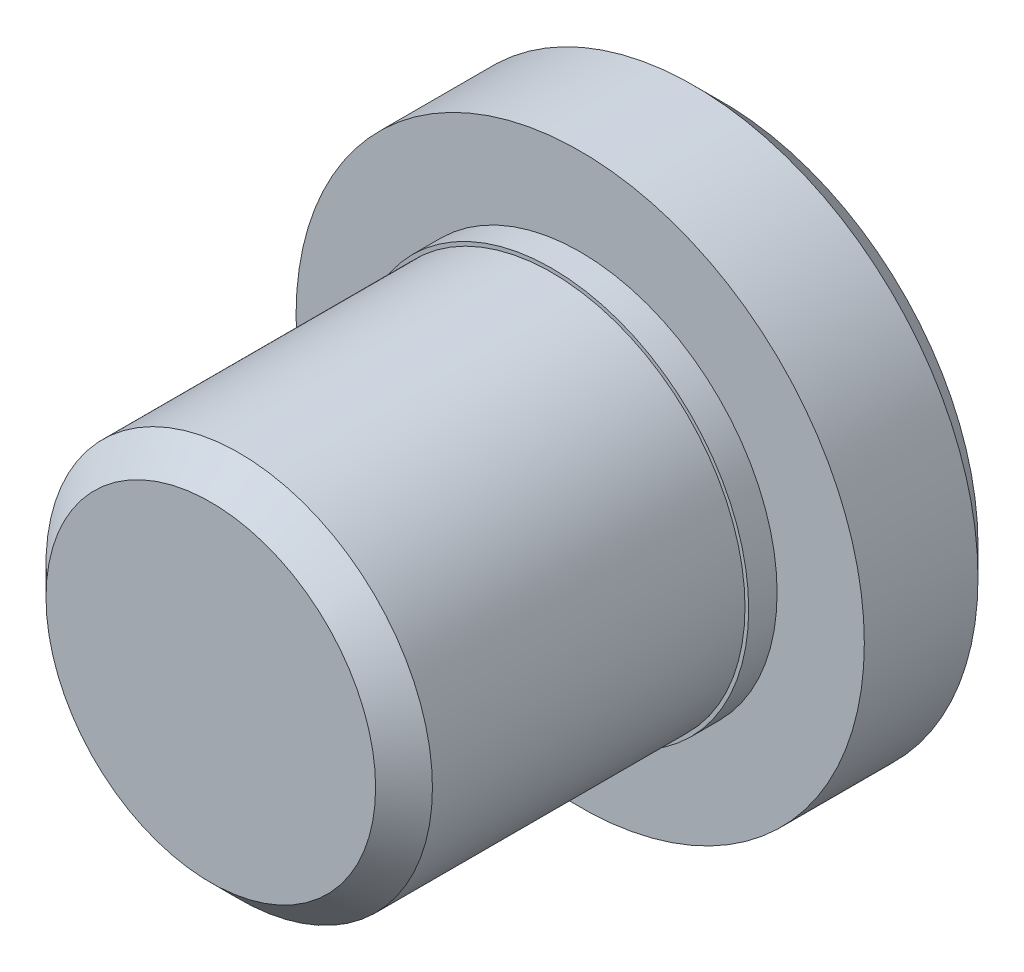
ISO-10303-21;
HEADER;
FILE_DESCRIPTION(('STEP AP214'),'2;1');
FILE_NAME('part.step','',(''),(''),'','','');
FILE_SCHEMA(('AUTOMOTIVE_DESIGN { 1 0 10303 214 1 1 1 1 }'));
ENDSEC;
DATA;
#1=APPLICATION_CONTEXT('core data for automotive mechanical design processes');
#2=APPLICATION_PROTOCOL_DEFINITION('international standard','automotive_design',2000,#1);
#3=PRODUCT_CONTEXT('',#1,'mechanical');
#4=PRODUCT('Part','Part','',(#3));
#5=PRODUCT_RELATED_PRODUCT_CATEGORY('part','',(#4));
#6=PRODUCT_DEFINITION_FORMATION('','',#4);
#7=PRODUCT_DEFINITION_CONTEXT('part definition',#1,'design');
#8=PRODUCT_DEFINITION('design','',#6,#7);
#9=PRODUCT_DEFINITION_SHAPE('','',#8);
#10=(LENGTH_UNIT() NAMED_UNIT(*) SI_UNIT(.MILLI.,.METRE.));
#11=(NAMED_UNIT(*) PLANE_ANGLE_UNIT() SI_UNIT($,.RADIAN.));
#12=(NAMED_UNIT(*) SI_UNIT($,.STERADIAN.) SOLID_ANGLE_UNIT());
#13=UNCERTAINTY_MEASURE_WITH_UNIT(LENGTH_MEASURE(1.E-05),#10,'distance_accuracy_value','');
#14=(GEOMETRIC_REPRESENTATION_CONTEXT(3) GLOBAL_UNCERTAINTY_ASSIGNED_CONTEXT((#13)) GLOBAL_UNIT_ASSIGNED_CONTEXT((#10,
#11,#12)) REPRESENTATION_CONTEXT('',''));
#15=CARTESIAN_POINT('',(0.,0.,0.));
#16=DIRECTION('',(0.,0.,1.));
#17=DIRECTION('',(1.,0.,0.));
#18=AXIS2_PLACEMENT_3D('',#15,#16,#17);
#19=CARTESIAN_POINT('',(0.,0.,0.));
#20=DIRECTION('',(0.,0.,1.));
#21=DIRECTION('',(1.,0.,0.));
#22=AXIS2_PLACEMENT_3D('',#19,#20,#21);
#23=CYLINDRICAL_SURFACE('',#22,1.621);
#24=CARTESIAN_POINT('',(0.,0.,6.99999999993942));
#25=DIRECTION('',(0.,0.,1.));
#26=DIRECTION('',(1.,0.,0.));
#27=AXIS2_PLACEMENT_3D('',#24,#25,#26);
#28=CIRCLE('',#27,1.621);
#29=CARTESIAN_POINT('',(1.621,0.,6.99999999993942));
#30=VERTEX_POINT('',#29);
#31=EDGE_CURVE('E11',#30,#30,#28,.T.);
#32=ORIENTED_EDGE('',*,*,#31,.T.);
#33=EDGE_LOOP('',(#32));
#34=FACE_BOUND('',#33,.T.);
#35=CARTESIAN_POINT('',(0.,0.,0.378999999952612));
#36=DIRECTION('',(0.,0.,1.));
#37=DIRECTION('',(1.,0.,0.));
#38=AXIS2_PLACEMENT_3D('',#35,#36,#37);
#39=CIRCLE('',#38,1.621);
#40=CARTESIAN_POINT('',(1.621,0.,0.378999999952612));
#41=VERTEX_POINT('',#40);
#42=EDGE_CURVE('E55',#41,#41,#39,.T.);
#43=ORIENTED_EDGE('',*,*,#42,.F.);
#44=EDGE_LOOP('',(#43));
#45=FACE_BOUND('',#44,.T.);
#46=ADVANCED_FACE('F36',(#34,#45),#23,.F.);
#47=CARTESIAN_POINT('',(0.,0.,6.99999999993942));
#48=DIRECTION('',(0.,0.,-1.));
#49=DIRECTION('',(-1.,0.,0.));
#50=AXIS2_PLACEMENT_3D('',#47,#48,#49);
#51=CONICAL_SURFACE('',#50,1.621,1.04719755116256);
#52=CARTESIAN_POINT('',(-6.37112433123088E-11,0.,7.93588478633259));
#53=VERTEX_POINT('',#52);
#54=VERTEX_LOOP('',#53);
#55=FACE_BOUND('',#54,.T.);
#56=ORIENTED_EDGE('',*,*,#31,.F.);
#57=EDGE_LOOP('',(#56));
#58=FACE_BOUND('',#57,.T.);
#59=ADVANCED_FACE('F45',(#55,#58),#51,.F.);
#60=CARTESIAN_POINT('',(-6.37112433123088E-11,0.,8.9999999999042));
#61=DIRECTION('',(0.,0.,1.));
#62=DIRECTION('',(1.,0.,0.));
#63=AXIS2_PLACEMENT_3D('',#60,#61,#62);
#64=PLANE('',#63);
#65=CARTESIAN_POINT('',(0.,0.,8.9999999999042));
#66=DIRECTION('',(0.,0.,1.));
#67=DIRECTION('',(1.,0.,0.));
#68=AXIS2_PLACEMENT_3D('',#65,#66,#67);
#69=CIRCLE('',#68,2.90000000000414);
#70=CARTESIAN_POINT('',(2.90000000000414,0.,8.9999999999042));
#71=VERTEX_POINT('',#70);
#72=EDGE_CURVE('E42',#71,#71,#69,.T.);
#73=ORIENTED_EDGE('',*,*,#72,.T.);
#74=EDGE_LOOP('',(#73));
#75=FACE_BOUND('',#74,.T.);
#76=ADVANCED_FACE('F48',(#75),#64,.T.);
#77=CARTESIAN_POINT('',(0.,0.,8.9999999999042));
#78=DIRECTION('',(0.,0.,-1.));
#79=DIRECTION('',(-1.,0.,0.));
#80=AXIS2_PLACEMENT_3D('',#77,#78,#79);
#81=CONICAL_SURFACE('',#80,2.90000000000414,0.785398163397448);
#82=CARTESIAN_POINT('',(0.,0.,8.49999999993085));
#83=DIRECTION('',(0.,0.,1.));
#84=DIRECTION('',(1.,0.,0.));
#85=AXIS2_PLACEMENT_3D('',#82,#83,#84);
#86=CIRCLE('',#85,3.39999999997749);
#87=CARTESIAN_POINT('',(3.39999999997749,0.,8.49999999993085));
#88=VERTEX_POINT('',#87);
#89=EDGE_CURVE('E80',#88,#88,#86,.T.);
#90=ORIENTED_EDGE('',*,*,#89,.T.);
#91=EDGE_LOOP('',(#90));
#92=FACE_BOUND('',#91,.T.);
#93=ORIENTED_EDGE('',*,*,#72,.F.);
#94=EDGE_LOOP('',(#93));
#95=FACE_BOUND('',#94,.T.);
#96=ADVANCED_FACE('F86',(#92,#95),#81,.T.);
#97=CARTESIAN_POINT('',(0.,0.,0.));
#98=DIRECTION('',(0.,0.,1.));
#99=DIRECTION('',(1.,0.,0.));
#100=AXIS2_PLACEMENT_3D('',#97,#98,#99);
#101=CYLINDRICAL_SURFACE('',#100,3.39999999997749);
#102=CARTESIAN_POINT('',(0.,0.,2.99999999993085));
#103=DIRECTION('',(0.,0.,1.));
#104=DIRECTION('',(1.,0.,0.));
#105=AXIS2_PLACEMENT_3D('',#102,#103,#104);
#106=CIRCLE('',#105,3.39999999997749);
#107=CARTESIAN_POINT('',(3.39999999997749,0.,2.99999999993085));
#108=VERTEX_POINT('',#107);
#109=EDGE_CURVE('E77',#108,#108,#106,.T.);
#110=ORIENTED_EDGE('',*,*,#109,.T.);
#111=EDGE_LOOP('',(#110));
#112=FACE_BOUND('',#111,.T.);
#113=ORIENTED_EDGE('',*,*,#89,.F.);
#114=EDGE_LOOP('',(#113));
#115=FACE_BOUND('',#114,.T.);
#116=ADVANCED_FACE('F88',(#112,#115),#101,.T.);
#117=CARTESIAN_POINT('',(3.39999999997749,0.,2.99999999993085));
#118=DIRECTION('',(0.,0.,1.));
#119=DIRECTION('',(1.,0.,0.));
#120=AXIS2_PLACEMENT_3D('',#117,#118,#119);
#121=PLANE('',#120);
#122=CARTESIAN_POINT('',(0.,0.,2.99999999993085));
#123=DIRECTION('',(0.,0.,1.));
#124=DIRECTION('',(1.,0.,0.));
#125=AXIS2_PLACEMENT_3D('',#122,#123,#124);
#126=CIRCLE('',#125,3.46499999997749);
#127=CARTESIAN_POINT('',(3.46499999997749,0.,2.99999999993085));
#128=VERTEX_POINT('',#127);
#129=EDGE_CURVE('E74',#128,#128,#126,.T.);
#130=ORIENTED_EDGE('',*,*,#129,.T.);
#131=EDGE_LOOP('',(#130));
#132=FACE_BOUND('',#131,.T.);
#133=ORIENTED_EDGE('',*,*,#109,.F.);
#134=EDGE_LOOP('',(#133));
#135=FACE_BOUND('',#134,.T.);
#136=ADVANCED_FACE('F95',(#132,#135),#121,.T.);
#137=CARTESIAN_POINT('',(0.,0.,0.));
#138=DIRECTION('',(0.,0.,1.));
#139=DIRECTION('',(1.,0.,0.));
#140=AXIS2_PLACEMENT_3D('',#137,#138,#139);
#141=CYLINDRICAL_SURFACE('',#140,3.46499999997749);
#142=CARTESIAN_POINT('',(0.,0.,2.49999999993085));
#143=DIRECTION('',(0.,0.,1.));
#144=DIRECTION('',(1.,0.,0.));
#145=AXIS2_PLACEMENT_3D('',#142,#143,#144);
#146=CIRCLE('',#145,3.46499999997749);
#147=CARTESIAN_POINT('',(3.46499999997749,0.,2.49999999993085));
#148=VERTEX_POINT('',#147);
#149=EDGE_CURVE('E71',#148,#148,#146,.T.);
#150=ORIENTED_EDGE('',*,*,#149,.T.);
#151=EDGE_LOOP('',(#150));
#152=FACE_BOUND('',#151,.T.);
#153=ORIENTED_EDGE('',*,*,#129,.F.);
#154=EDGE_LOOP('',(#153));
#155=FACE_BOUND('',#154,.T.);
#156=ADVANCED_FACE('F102',(#152,#155),#141,.T.);
#157=CARTESIAN_POINT('',(3.46499999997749,0.,2.49999999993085));
#158=DIRECTION('',(0.,0.,1.));
#159=DIRECTION('',(1.,0.,0.));
#160=AXIS2_PLACEMENT_3D('',#157,#158,#159);
#161=PLANE('',#160);
#162=CARTESIAN_POINT('',(0.,0.,2.49999999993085));
#163=DIRECTION('',(0.,0.,1.));
#164=DIRECTION('',(1.,0.,0.));
#165=AXIS2_PLACEMENT_3D('',#162,#163,#164);
#166=CIRCLE('',#165,5.00000000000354);
#167=CARTESIAN_POINT('',(5.00000000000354,0.,2.49999999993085));
#168=VERTEX_POINT('',#167);
#169=EDGE_CURVE('E68',#168,#168,#166,.T.);
#170=ORIENTED_EDGE('',*,*,#169,.T.);
#171=EDGE_LOOP('',(#170));
#172=FACE_BOUND('',#171,.T.);
#173=ORIENTED_EDGE('',*,*,#149,.F.);
#174=EDGE_LOOP('',(#173));
#175=FACE_BOUND('',#174,.T.);
#176=ADVANCED_FACE('F106',(#172,#175),#161,.T.);
#177=CARTESIAN_POINT('',(0.,0.,0.));
#178=DIRECTION('',(0.,0.,1.));
#179=DIRECTION('',(1.,0.,0.));
#180=AXIS2_PLACEMENT_3D('',#177,#178,#179);
#181=CYLINDRICAL_SURFACE('',#180,5.00000000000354);
#182=CARTESIAN_POINT('',(0.,0.,0.499999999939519));
#183=DIRECTION('',(0.,0.,1.));
#184=DIRECTION('',(1.,0.,0.));
#185=AXIS2_PLACEMENT_3D('',#182,#183,#184);
#186=CIRCLE('',#185,5.00000000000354);
#187=CARTESIAN_POINT('',(5.00000000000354,0.,0.499999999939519));
#188=VERTEX_POINT('',#187);
#189=EDGE_CURVE('E65',#188,#188,#186,.T.);
#190=ORIENTED_EDGE('',*,*,#189,.T.);
#191=EDGE_LOOP('',(#190));
#192=FACE_BOUND('',#191,.T.);
#193=ORIENTED_EDGE('',*,*,#169,.F.);
#194=EDGE_LOOP('',(#193));
#195=FACE_BOUND('',#194,.T.);
#196=ADVANCED_FACE('F110',(#192,#195),#181,.T.);
#197=CARTESIAN_POINT('',(0.,0.,0.499999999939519));
#198=DIRECTION('',(0.,0.,1.));
#199=DIRECTION('',(1.,0.,0.));
#200=AXIS2_PLACEMENT_3D('',#197,#198,#199);
#201=CONICAL_SURFACE('',#200,5.00000000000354,0.785398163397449);
#202=CARTESIAN_POINT('',(0.,0.,-2.84218167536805E-11));
#203=DIRECTION('',(0.,0.,1.));
#204=DIRECTION('',(1.,0.,0.));
#205=AXIS2_PLACEMENT_3D('',#202,#203,#204);
#206=CIRCLE('',#205,4.5000000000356);
#207=CARTESIAN_POINT('',(4.5000000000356,0.,-2.84218167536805E-11));
#208=VERTEX_POINT('',#207);
#209=EDGE_CURVE('E60',#208,#208,#206,.T.);
#210=ORIENTED_EDGE('',*,*,#209,.T.);
#211=EDGE_LOOP('',(#210));
#212=FACE_BOUND('',#211,.T.);
#213=ORIENTED_EDGE('',*,*,#189,.F.);
#214=EDGE_LOOP('',(#213));
#215=FACE_BOUND('',#214,.T.);
#216=ADVANCED_FACE('F114',(#212,#215),#201,.T.);
#217=CARTESIAN_POINT('',(4.5000000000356,0.,-2.84218167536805E-11));
#218=DIRECTION('',(0.,0.,-1.));
#219=DIRECTION('',(-1.,0.,0.));
#220=AXIS2_PLACEMENT_3D('',#217,#218,#219);
#221=PLANE('',#220);
#222=CARTESIAN_POINT('',(0.,0.,-2.84218167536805E-11));
#223=DIRECTION('',(0.,0.,1.));
#224=DIRECTION('',(1.,0.,0.));
#225=AXIS2_PLACEMENT_3D('',#222,#223,#224);
#226=CIRCLE('',#225,1.99999999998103);
#227=CARTESIAN_POINT('',(1.99999999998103,0.,-2.84218167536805E-11));
#228=VERTEX_POINT('',#227);
#229=EDGE_CURVE('E57',#228,#228,#226,.T.);
#230=ORIENTED_EDGE('',*,*,#229,.T.);
#231=EDGE_LOOP('',(#230));
#232=FACE_BOUND('',#231,.T.);
#233=ORIENTED_EDGE('',*,*,#209,.F.);
#234=EDGE_LOOP('',(#233));
#235=FACE_BOUND('',#234,.T.);
#236=ADVANCED_FACE('F118',(#232,#235),#221,.T.);
#237=CARTESIAN_POINT('',(0.,0.,-2.84218167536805E-11));
#238=DIRECTION('',(0.,0.,-1.));
#239=DIRECTION('',(-1.,0.,0.));
#240=AXIS2_PLACEMENT_3D('',#237,#238,#239);
#241=CONICAL_SURFACE('',#240,1.99999999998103,0.785398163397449);
#242=ORIENTED_EDGE('',*,*,#42,.T.);
#243=EDGE_LOOP('',(#242));
#244=FACE_BOUND('',#243,.T.);
#245=ORIENTED_EDGE('',*,*,#229,.F.);
#246=EDGE_LOOP('',(#245));
#247=FACE_BOUND('',#246,.T.);
#248=ADVANCED_FACE('F122',(#244,#247),#241,.F.);
#249=CLOSED_SHELL('',(#46,#59,#76,#96,#116,#136,#156,#176,#196,#216,#236,#248));
#250=MANIFOLD_SOLID_BREP('B2',#249);
#251=ADVANCED_BREP_SHAPE_REPRESENTATION('',(#18,#250),#14);
#252=SHAPE_DEFINITION_REPRESENTATION(#9,#251);
ENDSEC;
END-ISO-10303-21;
